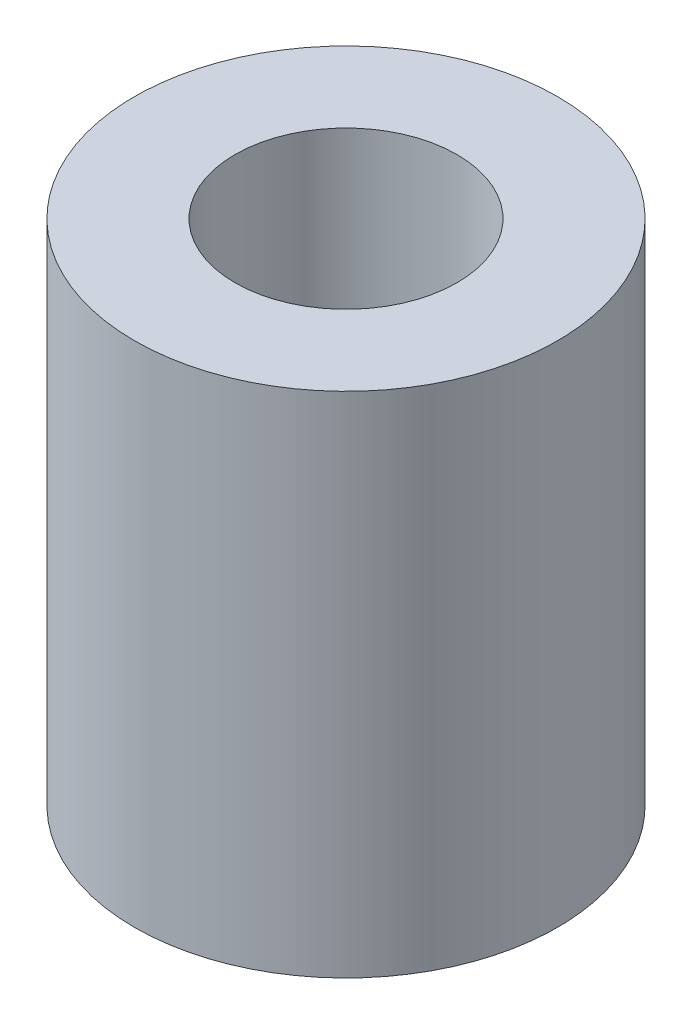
ISO-10303-21;
HEADER;
FILE_DESCRIPTION(('STEP AP214'),'2;1');
FILE_NAME('part.step','',(''),(''),'','','');
FILE_SCHEMA(('AUTOMOTIVE_DESIGN { 1 0 10303 214 1 1 1 1 }'));
ENDSEC;
DATA;
#1=APPLICATION_CONTEXT('core data for automotive mechanical design processes');
#2=APPLICATION_PROTOCOL_DEFINITION('international standard','automotive_design',2000,#1);
#3=PRODUCT_CONTEXT('',#1,'mechanical');
#4=PRODUCT('Part','Part','',(#3));
#5=PRODUCT_RELATED_PRODUCT_CATEGORY('part','',(#4));
#6=PRODUCT_DEFINITION_FORMATION('','',#4);
#7=PRODUCT_DEFINITION_CONTEXT('part definition',#1,'design');
#8=PRODUCT_DEFINITION('design','',#6,#7);
#9=PRODUCT_DEFINITION_SHAPE('','',#8);
#10=(LENGTH_UNIT() NAMED_UNIT(*) SI_UNIT(.MILLI.,.METRE.));
#11=(NAMED_UNIT(*) PLANE_ANGLE_UNIT() SI_UNIT($,.RADIAN.));
#12=(NAMED_UNIT(*) SI_UNIT($,.STERADIAN.) SOLID_ANGLE_UNIT());
#13=UNCERTAINTY_MEASURE_WITH_UNIT(LENGTH_MEASURE(1.E-05),#10,'distance_accuracy_value','');
#14=(GEOMETRIC_REPRESENTATION_CONTEXT(3) GLOBAL_UNCERTAINTY_ASSIGNED_CONTEXT((#13)) GLOBAL_UNIT_ASSIGNED_CONTEXT((#10,
#11,#12)) REPRESENTATION_CONTEXT('',''));
#15=CARTESIAN_POINT('',(0.,0.,0.));
#16=DIRECTION('',(0.,0.,1.));
#17=DIRECTION('',(1.,0.,0.));
#18=AXIS2_PLACEMENT_3D('',#15,#16,#17);
#19=CARTESIAN_POINT('',(0.,9.61,0.));
#20=DIRECTION('',(0.,1.,0.));
#21=DIRECTION('',(0.,0.,1.));
#22=AXIS2_PLACEMENT_3D('',#19,#20,#21);
#23=PLANE('',#22);
#24=CARTESIAN_POINT('',(0.,9.61,0.));
#25=DIRECTION('',(0.,1.,0.));
#26=DIRECTION('',(0.,0.,1.));
#27=AXIS2_PLACEMENT_3D('',#24,#25,#26);
#28=CIRCLE('',#27,4.);
#29=CARTESIAN_POINT('',(0.,9.61,4.));
#30=VERTEX_POINT('',#29);
#31=EDGE_CURVE('E10',#30,#30,#28,.T.);
#32=ORIENTED_EDGE('',*,*,#31,.T.);
#33=EDGE_LOOP('',(#32));
#34=FACE_BOUND('',#33,.T.);
#35=CARTESIAN_POINT('',(0.,9.61,0.));
#36=DIRECTION('',(0.,1.,0.));
#37=DIRECTION('',(0.,0.,1.));
#38=AXIS2_PLACEMENT_3D('',#35,#36,#37);
#39=CIRCLE('',#38,2.1);
#40=CARTESIAN_POINT('',(0.,9.61,2.1));
#41=VERTEX_POINT('',#40);
#42=EDGE_CURVE('E54',#41,#41,#39,.T.);
#43=ORIENTED_EDGE('',*,*,#42,.F.);
#44=EDGE_LOOP('',(#43));
#45=FACE_BOUND('',#44,.T.);
#46=ADVANCED_FACE('F41',(#34,#45),#23,.T.);
#47=CARTESIAN_POINT('',(0.,0.,0.));
#48=DIRECTION('',(0.,1.,0.));
#49=DIRECTION('',(0.,0.,1.));
#50=AXIS2_PLACEMENT_3D('',#47,#48,#49);
#51=PLANE('',#50);
#52=CARTESIAN_POINT('',(0.,0.,0.));
#53=DIRECTION('',(0.,1.,0.));
#54=DIRECTION('',(0.,0.,1.));
#55=AXIS2_PLACEMENT_3D('',#52,#53,#54);
#56=CIRCLE('',#55,4.);
#57=CARTESIAN_POINT('',(0.,0.,4.));
#58=VERTEX_POINT('',#57);
#59=EDGE_CURVE('E45',#58,#58,#56,.T.);
#60=ORIENTED_EDGE('',*,*,#59,.F.);
#61=EDGE_LOOP('',(#60));
#62=FACE_BOUND('',#61,.T.);
#63=CARTESIAN_POINT('',(0.,0.,0.));
#64=DIRECTION('',(0.,1.,0.));
#65=DIRECTION('',(0.,0.,1.));
#66=AXIS2_PLACEMENT_3D('',#63,#64,#65);
#67=CIRCLE('',#66,2.1);
#68=CARTESIAN_POINT('',(0.,0.,2.1));
#69=VERTEX_POINT('',#68);
#70=EDGE_CURVE('E56',#69,#69,#67,.T.);
#71=ORIENTED_EDGE('',*,*,#70,.T.);
#72=EDGE_LOOP('',(#71));
#73=FACE_BOUND('',#72,.T.);
#74=ADVANCED_FACE('F68',(#62,#73),#51,.F.);
#75=CARTESIAN_POINT('',(0.,9.61,0.));
#76=DIRECTION('',(0.,-1.,0.));
#77=DIRECTION('',(0.,0.,-1.));
#78=AXIS2_PLACEMENT_3D('',#75,#76,#77);
#79=CYLINDRICAL_SURFACE('',#78,4.);
#80=ORIENTED_EDGE('',*,*,#31,.F.);
#81=EDGE_LOOP('',(#80));
#82=FACE_BOUND('',#81,.T.);
#83=ORIENTED_EDGE('',*,*,#59,.T.);
#84=EDGE_LOOP('',(#83));
#85=FACE_BOUND('',#84,.T.);
#86=ADVANCED_FACE('F43',(#82,#85),#79,.T.);
#87=CARTESIAN_POINT('',(0.,9.61,0.));
#88=DIRECTION('',(0.,-1.,0.));
#89=DIRECTION('',(0.,0.,-1.));
#90=AXIS2_PLACEMENT_3D('',#87,#88,#89);
#91=CYLINDRICAL_SURFACE('',#90,2.1);
#92=ORIENTED_EDGE('',*,*,#42,.T.);
#93=EDGE_LOOP('',(#92));
#94=FACE_BOUND('',#93,.T.);
#95=ORIENTED_EDGE('',*,*,#70,.F.);
#96=EDGE_LOOP('',(#95));
#97=FACE_BOUND('',#96,.T.);
#98=ADVANCED_FACE('F64',(#94,#97),#91,.F.);
#99=CLOSED_SHELL('',(#46,#74,#86,#98));
#100=MANIFOLD_SOLID_BREP('B2',#99);
#101=ADVANCED_BREP_SHAPE_REPRESENTATION('',(#18,#100),#14);
#102=SHAPE_DEFINITION_REPRESENTATION(#9,#101);
ENDSEC;
END-ISO-10303-21;
